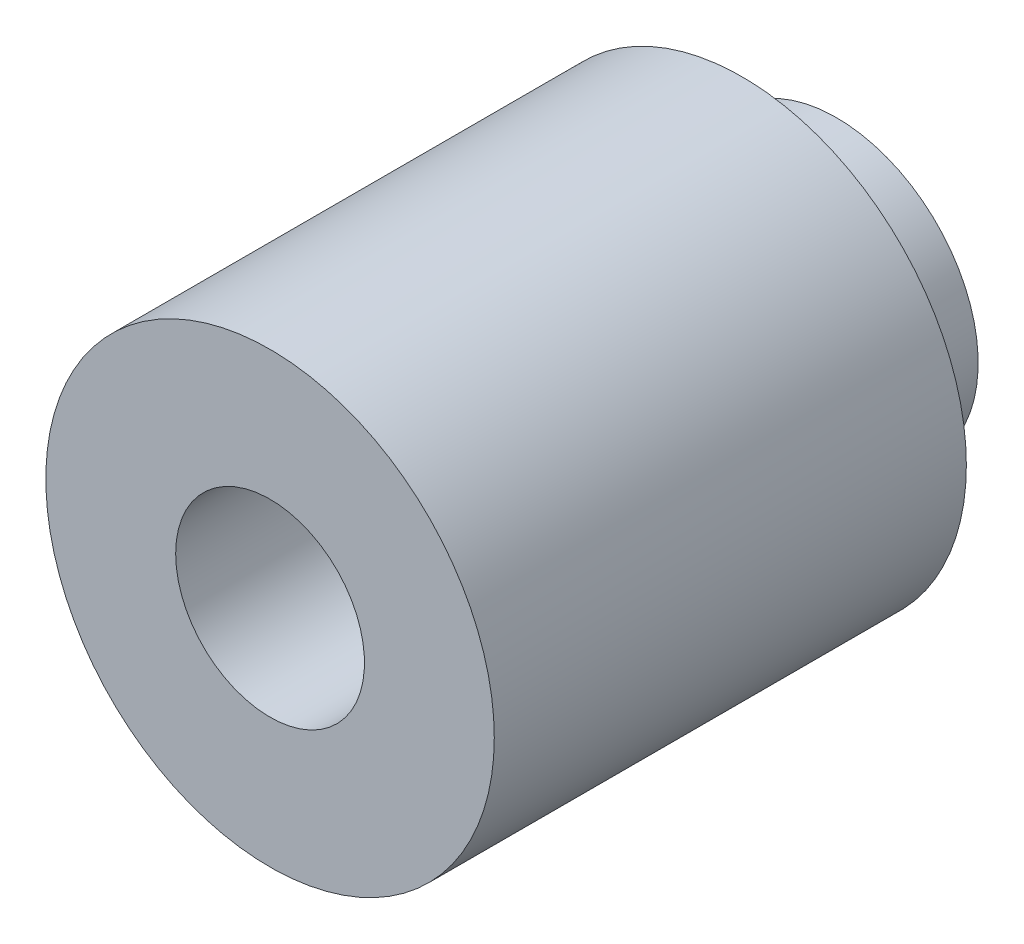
ISO-10303-21;
HEADER;
FILE_DESCRIPTION(('STEP AP214'),'2;1');
FILE_NAME('part.step','',(''),(''),'','','');
FILE_SCHEMA(('AUTOMOTIVE_DESIGN { 1 0 10303 214 1 1 1 1 }'));
ENDSEC;
DATA;
#1=APPLICATION_CONTEXT('core data for automotive mechanical design processes');
#2=APPLICATION_PROTOCOL_DEFINITION('international standard','automotive_design',2000,#1);
#3=PRODUCT_CONTEXT('',#1,'mechanical');
#4=PRODUCT('Part','Part','',(#3));
#5=PRODUCT_RELATED_PRODUCT_CATEGORY('part','',(#4));
#6=PRODUCT_DEFINITION_FORMATION('','',#4);
#7=PRODUCT_DEFINITION_CONTEXT('part definition',#1,'design');
#8=PRODUCT_DEFINITION('design','',#6,#7);
#9=PRODUCT_DEFINITION_SHAPE('','',#8);
#10=(LENGTH_UNIT() NAMED_UNIT(*) SI_UNIT(.MILLI.,.METRE.));
#11=(NAMED_UNIT(*) PLANE_ANGLE_UNIT() SI_UNIT($,.RADIAN.));
#12=(NAMED_UNIT(*) SI_UNIT($,.STERADIAN.) SOLID_ANGLE_UNIT());
#13=UNCERTAINTY_MEASURE_WITH_UNIT(LENGTH_MEASURE(1.E-05),#10,'distance_accuracy_value','');
#14=(GEOMETRIC_REPRESENTATION_CONTEXT(3) GLOBAL_UNCERTAINTY_ASSIGNED_CONTEXT((#13)) GLOBAL_UNIT_ASSIGNED_CONTEXT((#10,
#11,#12)) REPRESENTATION_CONTEXT('',''));
#15=CARTESIAN_POINT('',(0.,0.,0.));
#16=DIRECTION('',(0.,0.,1.));
#17=DIRECTION('',(1.,0.,0.));
#18=AXIS2_PLACEMENT_3D('',#15,#16,#17);
#19=CARTESIAN_POINT('',(0.,0.,44.));
#20=DIRECTION('',(0.,0.,1.));
#21=DIRECTION('',(1.,0.,0.));
#22=AXIS2_PLACEMENT_3D('',#19,#20,#21);
#23=CYLINDRICAL_SURFACE('',#22,9.5);
#24=CARTESIAN_POINT('',(0.,0.,24.));
#25=DIRECTION('',(0.,0.,1.));
#26=DIRECTION('',(1.,0.,0.));
#27=AXIS2_PLACEMENT_3D('',#24,#25,#26);
#28=CIRCLE('',#27,9.5);
#29=CARTESIAN_POINT('',(9.5,0.,24.));
#30=VERTEX_POINT('',#29);
#31=EDGE_CURVE('E8',#30,#30,#28,.T.);
#32=ORIENTED_EDGE('',*,*,#31,.F.);
#33=EDGE_LOOP('',(#32));
#34=FACE_BOUND('',#33,.T.);
#35=CARTESIAN_POINT('',(0.,0.,4.));
#36=DIRECTION('',(0.,0.,-1.));
#37=DIRECTION('',(-1.,0.,0.));
#38=AXIS2_PLACEMENT_3D('',#35,#36,#37);
#39=CIRCLE('',#38,9.5);
#40=CARTESIAN_POINT('',(-9.5,0.,4.));
#41=VERTEX_POINT('',#40);
#42=EDGE_CURVE('E28',#41,#41,#39,.F.);
#43=ORIENTED_EDGE('',*,*,#42,.T.);
#44=EDGE_LOOP('',(#43));
#45=FACE_BOUND('',#44,.T.);
#46=ADVANCED_FACE('F12',(#34,#45),#23,.T.);
#47=CARTESIAN_POINT('',(0.,0.,24.));
#48=DIRECTION('',(0.,0.,1.));
#49=DIRECTION('',(1.,0.,0.));
#50=AXIS2_PLACEMENT_3D('',#47,#48,#49);
#51=PLANE('',#50);
#52=ORIENTED_EDGE('',*,*,#31,.T.);
#53=EDGE_LOOP('',(#52));
#54=FACE_BOUND('',#53,.T.);
#55=CARTESIAN_POINT('',(0.,0.,24.));
#56=DIRECTION('',(0.,0.,-1.));
#57=DIRECTION('',(-1.,0.,0.));
#58=AXIS2_PLACEMENT_3D('',#55,#56,#57);
#59=CIRCLE('',#58,4.);
#60=CARTESIAN_POINT('',(-4.,0.,24.));
#61=VERTEX_POINT('',#60);
#62=EDGE_CURVE('E25',#61,#61,#59,.T.);
#63=ORIENTED_EDGE('',*,*,#62,.T.);
#64=EDGE_LOOP('',(#63));
#65=FACE_BOUND('',#64,.T.);
#66=ADVANCED_FACE('F41',(#54,#65),#51,.T.);
#67=CARTESIAN_POINT('',(0.,0.,15.5));
#68=DIRECTION('',(0.,0.,1.));
#69=DIRECTION('',(1.,0.,0.));
#70=AXIS2_PLACEMENT_3D('',#67,#68,#69);
#71=CYLINDRICAL_SURFACE('',#70,4.);
#72=CARTESIAN_POINT('',(0.,0.,15.5));
#73=DIRECTION('',(0.,0.,-1.));
#74=DIRECTION('',(-1.,0.,0.));
#75=AXIS2_PLACEMENT_3D('',#72,#73,#74);
#76=CIRCLE('',#75,4.);
#77=CARTESIAN_POINT('',(-4.,0.,15.5));
#78=VERTEX_POINT('',#77);
#79=EDGE_CURVE('E20',#78,#78,#76,.T.);
#80=ORIENTED_EDGE('',*,*,#79,.T.);
#81=EDGE_LOOP('',(#80));
#82=FACE_BOUND('',#81,.T.);
#83=ORIENTED_EDGE('',*,*,#62,.F.);
#84=EDGE_LOOP('',(#83));
#85=FACE_BOUND('',#84,.T.);
#86=ADVANCED_FACE('F43',(#82,#85),#71,.F.);
#87=CARTESIAN_POINT('',(0.,0.,15.5));
#88=DIRECTION('',(0.,0.,-1.));
#89=DIRECTION('',(-1.,0.,0.));
#90=AXIS2_PLACEMENT_3D('',#87,#88,#89);
#91=PLANE('',#90);
#92=ORIENTED_EDGE('',*,*,#79,.F.);
#93=EDGE_LOOP('',(#92));
#94=FACE_BOUND('',#93,.T.);
#95=ADVANCED_FACE('F45',(#94),#91,.F.);
#96=CARTESIAN_POINT('',(0.,0.,-16.));
#97=DIRECTION('',(0.,0.,-1.));
#98=DIRECTION('',(-1.,0.,0.));
#99=AXIS2_PLACEMENT_3D('',#96,#97,#98);
#100=CYLINDRICAL_SURFACE('',#99,6.);
#101=CARTESIAN_POINT('',(0.,0.,0.));
#102=DIRECTION('',(0.,0.,-1.));
#103=DIRECTION('',(-1.,0.,0.));
#104=AXIS2_PLACEMENT_3D('',#101,#102,#103);
#105=CIRCLE('',#104,6.);
#106=CARTESIAN_POINT('',(-6.,0.,0.));
#107=VERTEX_POINT('',#106);
#108=EDGE_CURVE('E16',#107,#107,#105,.F.);
#109=ORIENTED_EDGE('',*,*,#108,.T.);
#110=EDGE_LOOP('',(#109));
#111=FACE_BOUND('',#110,.T.);
#112=CARTESIAN_POINT('',(0.,0.,4.));
#113=DIRECTION('',(0.,0.,-1.));
#114=DIRECTION('',(-1.,0.,0.));
#115=AXIS2_PLACEMENT_3D('',#112,#113,#114);
#116=CIRCLE('',#115,6.);
#117=CARTESIAN_POINT('',(-6.,0.,4.));
#118=VERTEX_POINT('',#117);
#119=EDGE_CURVE('E30',#118,#118,#116,.T.);
#120=ORIENTED_EDGE('',*,*,#119,.T.);
#121=EDGE_LOOP('',(#120));
#122=FACE_BOUND('',#121,.T.);
#123=ADVANCED_FACE('F48',(#111,#122),#100,.T.);
#124=CARTESIAN_POINT('',(0.,6.,4.));
#125=DIRECTION('',(0.,0.,-1.));
#126=DIRECTION('',(-1.,0.,0.));
#127=AXIS2_PLACEMENT_3D('',#124,#125,#126);
#128=PLANE('',#127);
#129=ORIENTED_EDGE('',*,*,#42,.F.);
#130=EDGE_LOOP('',(#129));
#131=FACE_BOUND('',#130,.T.);
#132=ORIENTED_EDGE('',*,*,#119,.F.);
#133=EDGE_LOOP('',(#132));
#134=FACE_BOUND('',#133,.T.);
#135=ADVANCED_FACE('F58',(#131,#134),#128,.T.);
#136=CARTESIAN_POINT('',(9.5,0.,0.));
#137=DIRECTION('',(0.,0.,-1.));
#138=DIRECTION('',(-1.,0.,0.));
#139=AXIS2_PLACEMENT_3D('',#136,#137,#138);
#140=PLANE('',#139);
#141=ORIENTED_EDGE('',*,*,#108,.F.);
#142=EDGE_LOOP('',(#141));
#143=FACE_BOUND('',#142,.T.);
#144=ADVANCED_FACE('F14',(#143),#140,.T.);
#145=CLOSED_SHELL('',(#46,#66,#86,#95,#123,#135,#144));
#146=MANIFOLD_SOLID_BREP('B1',#145);
#147=ADVANCED_BREP_SHAPE_REPRESENTATION('',(#18,#146),#14);
#148=SHAPE_DEFINITION_REPRESENTATION(#9,#147);
ENDSEC;
END-ISO-10303-21;
